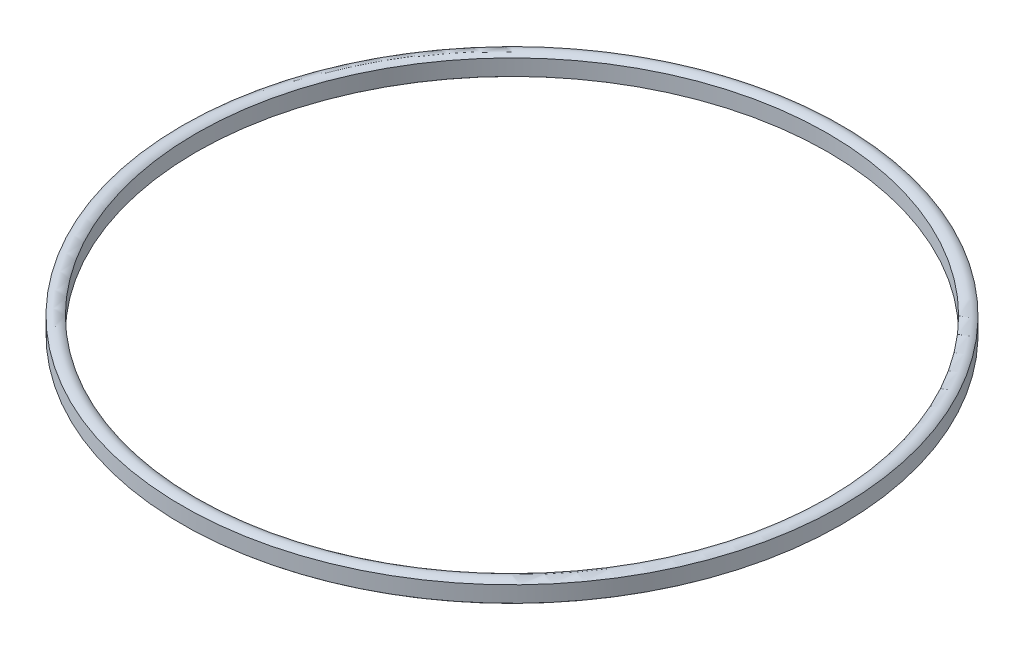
ISO-10303-21;
HEADER;
FILE_DESCRIPTION(('STEP AP214'),'2;1');
FILE_NAME('part.step','',(''),(''),'','','');
FILE_SCHEMA(('AUTOMOTIVE_DESIGN { 1 0 10303 214 1 1 1 1 }'));
ENDSEC;
DATA;
#1=APPLICATION_CONTEXT('core data for automotive mechanical design processes');
#2=APPLICATION_PROTOCOL_DEFINITION('international standard','automotive_design',2000,#1);
#3=PRODUCT_CONTEXT('',#1,'mechanical');
#4=PRODUCT('Part','Part','',(#3));
#5=PRODUCT_RELATED_PRODUCT_CATEGORY('part','',(#4));
#6=PRODUCT_DEFINITION_FORMATION('','',#4);
#7=PRODUCT_DEFINITION_CONTEXT('part definition',#1,'design');
#8=PRODUCT_DEFINITION('design','',#6,#7);
#9=PRODUCT_DEFINITION_SHAPE('','',#8);
#10=(LENGTH_UNIT() NAMED_UNIT(*) SI_UNIT(.MILLI.,.METRE.));
#11=(NAMED_UNIT(*) PLANE_ANGLE_UNIT() SI_UNIT($,.RADIAN.));
#12=(NAMED_UNIT(*) SI_UNIT($,.STERADIAN.) SOLID_ANGLE_UNIT());
#13=UNCERTAINTY_MEASURE_WITH_UNIT(LENGTH_MEASURE(1.E-05),#10,'distance_accuracy_value','');
#14=(GEOMETRIC_REPRESENTATION_CONTEXT(3) GLOBAL_UNCERTAINTY_ASSIGNED_CONTEXT((#13)) GLOBAL_UNIT_ASSIGNED_CONTEXT((#10,
#11,#12)) REPRESENTATION_CONTEXT('',''));
#15=CARTESIAN_POINT('',(0.,0.,0.));
#16=DIRECTION('',(0.,0.,1.));
#17=DIRECTION('',(1.,0.,0.));
#18=AXIS2_PLACEMENT_3D('',#15,#16,#17);
#19=CARTESIAN_POINT('',(0.,10.4696504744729,0.));
#20=DIRECTION('',(0.,1.,0.));
#21=DIRECTION('',(-1.,0.,0.));
#22=AXIS2_PLACEMENT_3D('',#19,#20,#21);
#23=CYLINDRICAL_SURFACE('',#22,29.9);
#24=CARTESIAN_POINT('',(0.,-0.759934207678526,0.));
#25=DIRECTION('',(0.,1.,0.));
#26=DIRECTION('',(-1.,0.,0.));
#27=AXIS2_PLACEMENT_3D('',#24,#25,#26);
#28=CIRCLE('',#27,29.9);
#29=CARTESIAN_POINT('',(-29.9,-0.759934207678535,0.));
#30=VERTEX_POINT('',#29);
#31=EDGE_CURVE('E44',#30,#30,#28,.T.);
#32=ORIENTED_EDGE('',*,*,#31,.F.);
#33=EDGE_LOOP('',(#32));
#34=FACE_BOUND('',#33,.T.);
#35=CARTESIAN_POINT('',(0.,0.759934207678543,0.));
#36=DIRECTION('',(0.,1.,0.));
#37=DIRECTION('',(-1.,0.,0.));
#38=AXIS2_PLACEMENT_3D('',#35,#36,#37);
#39=CIRCLE('',#38,29.9);
#40=CARTESIAN_POINT('',(-29.9,0.759934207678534,0.));
#41=VERTEX_POINT('',#40);
#42=EDGE_CURVE('E10',#41,#41,#39,.T.);
#43=ORIENTED_EDGE('',*,*,#42,.T.);
#44=EDGE_LOOP('',(#43));
#45=FACE_BOUND('',#44,.T.);
#46=ADVANCED_FACE('F30',(#34,#45),#23,.F.);
#47=CARTESIAN_POINT('',(0.,0.,0.));
#48=DIRECTION('',(0.,1.,0.));
#49=DIRECTION('',(-1.,0.,0.));
#50=AXIS2_PLACEMENT_3D('',#47,#48,#49);
#51=TOROIDAL_SURFACE('',#50,30.55,1.);
#52=CARTESIAN_POINT('',(0.,0.759934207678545,0.));
#53=DIRECTION('',(0.,1.,0.));
#54=DIRECTION('',(-1.,0.,0.));
#55=AXIS2_PLACEMENT_3D('',#52,#53,#54);
#56=CIRCLE('',#55,31.2);
#57=CARTESIAN_POINT('',(-31.2,0.759934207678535,0.));
#58=VERTEX_POINT('',#57);
#59=EDGE_CURVE('E36',#58,#58,#56,.T.);
#60=ORIENTED_EDGE('',*,*,#59,.T.);
#61=EDGE_LOOP('',(#60));
#62=FACE_BOUND('',#61,.T.);
#63=ORIENTED_EDGE('',*,*,#42,.F.);
#64=EDGE_LOOP('',(#63));
#65=FACE_BOUND('',#64,.T.);
#66=ADVANCED_FACE('F54',(#62,#65),#51,.T.);
#67=CARTESIAN_POINT('',(0.,10.4696504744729,0.));
#68=DIRECTION('',(0.,1.,0.));
#69=DIRECTION('',(-1.,0.,0.));
#70=AXIS2_PLACEMENT_3D('',#67,#68,#69);
#71=CYLINDRICAL_SURFACE('',#70,31.2);
#72=CARTESIAN_POINT('',(0.,-0.759934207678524,0.));
#73=DIRECTION('',(0.,1.,0.));
#74=DIRECTION('',(-1.,0.,0.));
#75=AXIS2_PLACEMENT_3D('',#72,#73,#74);
#76=CIRCLE('',#75,31.2);
#77=CARTESIAN_POINT('',(-31.2,-0.759934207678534,0.));
#78=VERTEX_POINT('',#77);
#79=EDGE_CURVE('E40',#78,#78,#76,.T.);
#80=ORIENTED_EDGE('',*,*,#79,.T.);
#81=EDGE_LOOP('',(#80));
#82=FACE_BOUND('',#81,.T.);
#83=ORIENTED_EDGE('',*,*,#59,.F.);
#84=EDGE_LOOP('',(#83));
#85=FACE_BOUND('',#84,.T.);
#86=ADVANCED_FACE('F58',(#82,#85),#71,.T.);
#87=ORIENTED_EDGE('',*,*,#31,.T.);
#88=EDGE_LOOP('',(#87));
#89=FACE_BOUND('',#88,.T.);
#90=ORIENTED_EDGE('',*,*,#79,.F.);
#91=EDGE_LOOP('',(#90));
#92=FACE_BOUND('',#91,.T.);
#93=ADVANCED_FACE('F50',(#89,#92),#51,.T.);
#94=CLOSED_SHELL('',(#46,#66,#86,#93));
#95=MANIFOLD_SOLID_BREP('B2',#94);
#96=ADVANCED_BREP_SHAPE_REPRESENTATION('',(#18,#95),#14);
#97=SHAPE_DEFINITION_REPRESENTATION(#9,#96);
ENDSEC;
END-ISO-10303-21;
